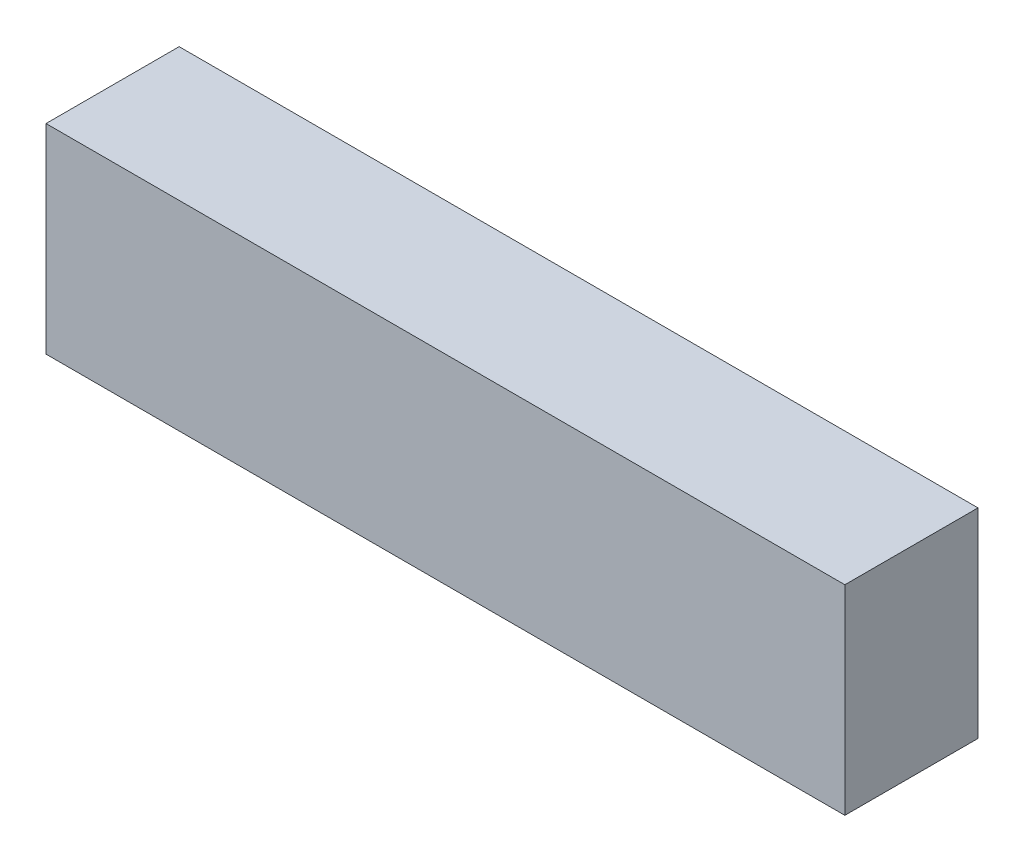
from build123d import *

# Parameters (mm, degrees)
ESQUISSE1_W        = 18
ESQUISSE1_H        = 4.5
BOSS_EXTRU_1_DEPTH = 3


with BuildPart() as part:
    # Esquisse1 → Boss.-Extru.1 (new body)
    with BuildSketch(Plane.XY):
        Rectangle(ESQUISSE1_W, ESQUISSE1_H)
    extrude(amount=BOSS_EXTRU_1_DEPTH)


solid = part.part
